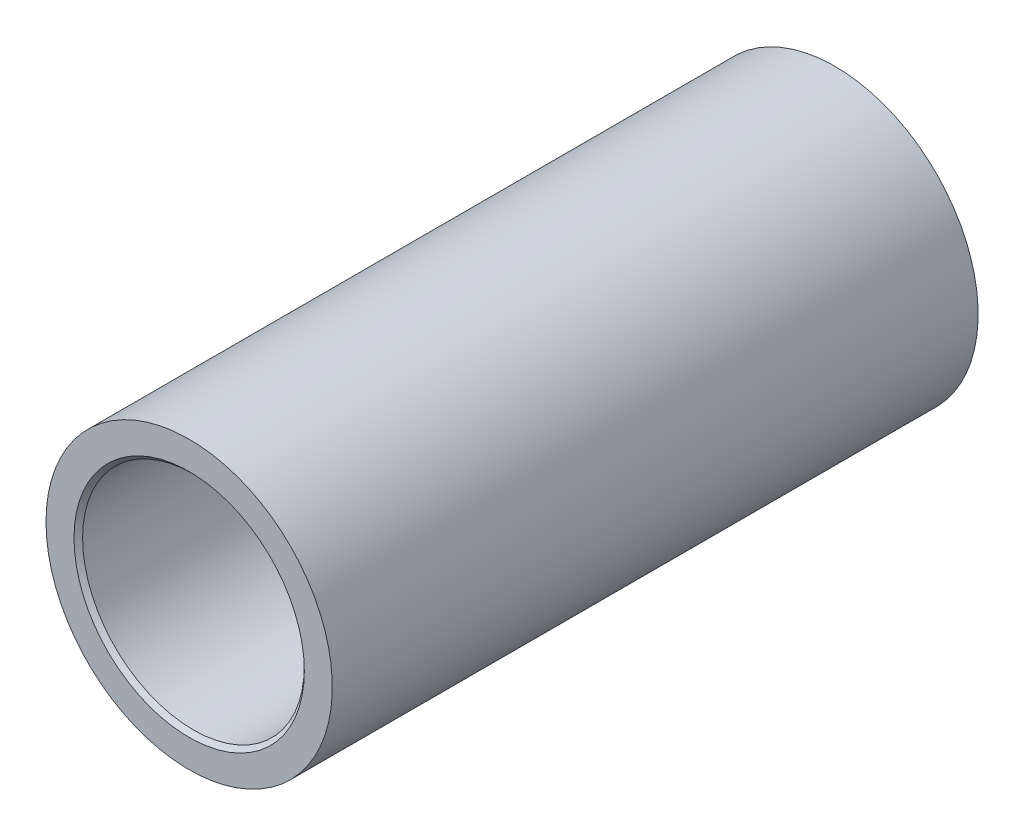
ISO-10303-21;
HEADER;
FILE_DESCRIPTION(('STEP AP214'),'2;1');
FILE_NAME('part.step','',(''),(''),'','','');
FILE_SCHEMA(('AUTOMOTIVE_DESIGN { 1 0 10303 214 1 1 1 1 }'));
ENDSEC;
DATA;
#1=APPLICATION_CONTEXT('core data for automotive mechanical design processes');
#2=APPLICATION_PROTOCOL_DEFINITION('international standard','automotive_design',2000,#1);
#3=PRODUCT_CONTEXT('',#1,'mechanical');
#4=PRODUCT('Part','Part','',(#3));
#5=PRODUCT_RELATED_PRODUCT_CATEGORY('part','',(#4));
#6=PRODUCT_DEFINITION_FORMATION('','',#4);
#7=PRODUCT_DEFINITION_CONTEXT('part definition',#1,'design');
#8=PRODUCT_DEFINITION('design','',#6,#7);
#9=PRODUCT_DEFINITION_SHAPE('','',#8);
#10=(LENGTH_UNIT() NAMED_UNIT(*) SI_UNIT(.MILLI.,.METRE.));
#11=(NAMED_UNIT(*) PLANE_ANGLE_UNIT() SI_UNIT($,.RADIAN.));
#12=(NAMED_UNIT(*) SI_UNIT($,.STERADIAN.) SOLID_ANGLE_UNIT());
#13=UNCERTAINTY_MEASURE_WITH_UNIT(LENGTH_MEASURE(1.E-05),#10,'distance_accuracy_value','');
#14=(GEOMETRIC_REPRESENTATION_CONTEXT(3) GLOBAL_UNCERTAINTY_ASSIGNED_CONTEXT((#13)) GLOBAL_UNIT_ASSIGNED_CONTEXT((#10,
#11,#12)) REPRESENTATION_CONTEXT('',''));
#15=CARTESIAN_POINT('',(0.,0.,0.));
#16=DIRECTION('',(0.,0.,1.));
#17=DIRECTION('',(1.,0.,0.));
#18=AXIS2_PLACEMENT_3D('',#15,#16,#17);
#19=CARTESIAN_POINT('',(0.,0.,38.1));
#20=DIRECTION('',(0.,0.,1.));
#21=DIRECTION('',(1.,0.,0.));
#22=AXIS2_PLACEMENT_3D('',#19,#20,#21);
#23=PLANE('',#22);
#24=CARTESIAN_POINT('',(0.,0.,38.1));
#25=DIRECTION('',(0.,0.,1.));
#26=DIRECTION('',(1.,0.,0.));
#27=AXIS2_PLACEMENT_3D('',#24,#25,#26);
#28=CIRCLE('',#27,6.79450000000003);
#29=CARTESIAN_POINT('',(6.79450000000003,0.,38.1));
#30=VERTEX_POINT('',#29);
#31=EDGE_CURVE('E10',#30,#30,#28,.F.);
#32=ORIENTED_EDGE('',*,*,#31,.T.);
#33=EDGE_LOOP('',(#32));
#34=FACE_BOUND('',#33,.T.);
#35=CARTESIAN_POINT('',(0.,0.,38.1));
#36=DIRECTION('',(0.,0.,1.));
#37=DIRECTION('',(1.,0.,0.));
#38=AXIS2_PLACEMENT_3D('',#35,#36,#37);
#39=CIRCLE('',#38,8.4455);
#40=CARTESIAN_POINT('',(-8.4455,0.,38.1));
#41=VERTEX_POINT('',#40);
#42=EDGE_CURVE('E56',#41,#41,#39,.T.);
#43=ORIENTED_EDGE('',*,*,#42,.T.);
#44=EDGE_LOOP('',(#43));
#45=FACE_BOUND('',#44,.T.);
#46=ADVANCED_FACE('F35',(#34,#45),#23,.T.);
#47=CARTESIAN_POINT('',(0.,0.,0.));
#48=DIRECTION('',(0.,0.,1.));
#49=DIRECTION('',(1.,0.,0.));
#50=AXIS2_PLACEMENT_3D('',#47,#48,#49);
#51=PLANE('',#50);
#52=CARTESIAN_POINT('',(0.,0.,0.));
#53=DIRECTION('',(0.,0.,1.));
#54=DIRECTION('',(1.,0.,0.));
#55=AXIS2_PLACEMENT_3D('',#52,#53,#54);
#56=CIRCLE('',#55,6.79449999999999);
#57=CARTESIAN_POINT('',(6.79449999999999,0.,0.));
#58=VERTEX_POINT('',#57);
#59=EDGE_CURVE('E51',#58,#58,#56,.T.);
#60=ORIENTED_EDGE('',*,*,#59,.T.);
#61=EDGE_LOOP('',(#60));
#62=FACE_BOUND('',#61,.T.);
#63=CARTESIAN_POINT('',(0.,0.,0.));
#64=DIRECTION('',(0.,0.,1.));
#65=DIRECTION('',(1.,0.,0.));
#66=AXIS2_PLACEMENT_3D('',#63,#64,#65);
#67=CIRCLE('',#66,8.4455);
#68=CARTESIAN_POINT('',(-8.4455,0.,0.));
#69=VERTEX_POINT('',#68);
#70=EDGE_CURVE('E57',#69,#69,#67,.T.);
#71=ORIENTED_EDGE('',*,*,#70,.F.);
#72=EDGE_LOOP('',(#71));
#73=FACE_BOUND('',#72,.T.);
#74=ADVANCED_FACE('F68',(#62,#73),#51,.F.);
#75=CARTESIAN_POINT('',(0.,0.,38.1));
#76=DIRECTION('',(0.,0.,-1.));
#77=DIRECTION('',(-1.,0.,0.));
#78=AXIS2_PLACEMENT_3D('',#75,#76,#77);
#79=CYLINDRICAL_SURFACE('',#78,8.4455);
#80=CARTESIAN_POINT('',(-8.4455,0.,38.1));
#81=CARTESIAN_POINT('',(-8.4455,0.,37.703125));
#82=CARTESIAN_POINT('',(-8.4455,0.,37.30625));
#83=CARTESIAN_POINT('',(-8.4455,0.,36.5125));
#84=CARTESIAN_POINT('',(-8.4455,0.,36.115625));
#85=CARTESIAN_POINT('',(-8.4455,0.,35.321875));
#86=CARTESIAN_POINT('',(-8.4455,0.,34.925));
#87=CARTESIAN_POINT('',(-8.4455,0.,34.13125));
#88=CARTESIAN_POINT('',(-8.4455,0.,33.734375));
#89=CARTESIAN_POINT('',(-8.4455,0.,32.940625));
#90=CARTESIAN_POINT('',(-8.4455,0.,32.54375));
#91=CARTESIAN_POINT('',(-8.4455,0.,31.75));
#92=CARTESIAN_POINT('',(-8.4455,0.,31.353125));
#93=CARTESIAN_POINT('',(-8.4455,0.,30.559375));
#94=CARTESIAN_POINT('',(-8.4455,0.,30.1625));
#95=CARTESIAN_POINT('',(-8.4455,0.,29.36875));
#96=CARTESIAN_POINT('',(-8.4455,0.,28.971875));
#97=CARTESIAN_POINT('',(-8.4455,0.,28.178125));
#98=CARTESIAN_POINT('',(-8.4455,0.,27.78125));
#99=CARTESIAN_POINT('',(-8.4455,0.,26.9875));
#100=CARTESIAN_POINT('',(-8.4455,0.,26.590625));
#101=CARTESIAN_POINT('',(-8.4455,0.,25.796875));
#102=CARTESIAN_POINT('',(-8.4455,0.,25.4));
#103=CARTESIAN_POINT('',(-8.4455,0.,24.60625));
#104=CARTESIAN_POINT('',(-8.4455,0.,24.209375));
#105=CARTESIAN_POINT('',(-8.4455,0.,23.415625));
#106=CARTESIAN_POINT('',(-8.4455,0.,23.01875));
#107=CARTESIAN_POINT('',(-8.4455,0.,22.225));
#108=CARTESIAN_POINT('',(-8.4455,0.,21.828125));
#109=CARTESIAN_POINT('',(-8.4455,0.,21.034375));
#110=CARTESIAN_POINT('',(-8.4455,0.,20.6375));
#111=CARTESIAN_POINT('',(-8.4455,0.,19.84375));
#112=CARTESIAN_POINT('',(-8.4455,0.,19.446875));
#113=CARTESIAN_POINT('',(-8.4455,0.,18.653125));
#114=CARTESIAN_POINT('',(-8.4455,0.,18.25625));
#115=CARTESIAN_POINT('',(-8.4455,0.,17.4625));
#116=CARTESIAN_POINT('',(-8.4455,0.,17.065625));
#117=CARTESIAN_POINT('',(-8.4455,0.,16.271875));
#118=CARTESIAN_POINT('',(-8.4455,0.,15.875));
#119=CARTESIAN_POINT('',(-8.4455,0.,15.08125));
#120=CARTESIAN_POINT('',(-8.4455,0.,14.684375));
#121=CARTESIAN_POINT('',(-8.4455,0.,13.890625));
#122=CARTESIAN_POINT('',(-8.4455,0.,13.49375));
#123=CARTESIAN_POINT('',(-8.4455,0.,12.7));
#124=CARTESIAN_POINT('',(-8.4455,0.,12.303125));
#125=CARTESIAN_POINT('',(-8.4455,0.,11.509375));
#126=CARTESIAN_POINT('',(-8.4455,0.,11.1125));
#127=CARTESIAN_POINT('',(-8.4455,0.,10.31875));
#128=CARTESIAN_POINT('',(-8.4455,0.,9.921875));
#129=CARTESIAN_POINT('',(-8.4455,0.,9.128125));
#130=CARTESIAN_POINT('',(-8.4455,0.,8.73125));
#131=CARTESIAN_POINT('',(-8.4455,0.,7.9375));
#132=CARTESIAN_POINT('',(-8.4455,0.,7.540625));
#133=CARTESIAN_POINT('',(-8.4455,0.,6.746875));
#134=CARTESIAN_POINT('',(-8.4455,0.,6.35));
#135=CARTESIAN_POINT('',(-8.4455,0.,5.55625));
#136=CARTESIAN_POINT('',(-8.4455,0.,5.159375));
#137=CARTESIAN_POINT('',(-8.4455,0.,4.365625));
#138=CARTESIAN_POINT('',(-8.4455,0.,3.96875));
#139=CARTESIAN_POINT('',(-8.4455,0.,3.175));
#140=CARTESIAN_POINT('',(-8.4455,0.,2.778125));
#141=CARTESIAN_POINT('',(-8.4455,0.,1.984375));
#142=CARTESIAN_POINT('',(-8.4455,0.,1.5875));
#143=CARTESIAN_POINT('',(-8.4455,0.,0.79375));
#144=CARTESIAN_POINT('',(-8.4455,0.,0.396875));
#145=CARTESIAN_POINT('',(-8.4455,0.,0.));
#146=B_SPLINE_CURVE_WITH_KNOTS('',3,(#80,#81,#82,#83,#84,#85,#86,#87,#88,#89,#90,#91,#92,#93,
#94,#95,#96,#97,#98,#99,#100,#101,#102,#103,#104,#105,#106,#107,#108,#109,#110,#111,#112,#113,
#114,#115,#116,#117,#118,#119,#120,#121,#122,#123,#124,#125,#126,#127,#128,#129,#130,#131,#132,
#133,#134,#135,#136,#137,#138,#139,#140,#141,#142,#143,#144,#145),.UNSPECIFIED.,.F.,.F.,(4,2,2,
2,2,2,2,2,2,2,2,2,2,2,2,2,2,2,2,2,2,2,2,2,2,2,2,2,2,2,2,2,4),(0.,1.19062499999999,
2.38124999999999,3.571875,4.7625,5.953125,7.14375,8.33437499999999,9.525,10.715625,11.90625,
13.096875,14.2875,15.478125,16.66875,17.859375,19.05,20.240625,21.43125,22.621875,23.8125,
25.003125,26.19375,27.384375,28.575,29.765625,30.95625,32.146875,33.3375,34.528125,35.71875,
36.909375,38.1),.UNSPECIFIED.);
#147=EDGE_CURVE('BSEAM64',#41,#69,#146,.T.);
#148=ORIENTED_EDGE('',*,*,#42,.F.);
#149=ORIENTED_EDGE('',*,*,#70,.T.);
#150=ORIENTED_EDGE('',*,*,#147,.T.);
#151=ORIENTED_EDGE('',*,*,#147,.F.);
#152=EDGE_LOOP('',(#148,#150,#149,#151));
#153=FACE_BOUND('',#152,.T.);
#154=ADVANCED_FACE('F64',(#153),#79,.T.);
#155=CARTESIAN_POINT('',(0.,0.,38.1));
#156=DIRECTION('',(0.,0.,-1.));
#157=DIRECTION('',(-1.,0.,0.));
#158=AXIS2_PLACEMENT_3D('',#155,#156,#157);
#159=CYLINDRICAL_SURFACE('',#158,6.5405);
#160=CARTESIAN_POINT('',(0.,0.,0.25399999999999));
#161=DIRECTION('',(0.,0.,1.));
#162=DIRECTION('',(1.,0.,0.));
#163=AXIS2_PLACEMENT_3D('',#160,#161,#162);
#164=CIRCLE('',#163,6.5405);
#165=CARTESIAN_POINT('',(-6.5405,0.,0.25399999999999));
#166=VERTEX_POINT('',#165);
#167=EDGE_CURVE('E43',#166,#166,#164,.F.);
#168=CARTESIAN_POINT('',(0.,0.,37.846));
#169=DIRECTION('',(0.,0.,1.));
#170=DIRECTION('',(1.,0.,0.));
#171=AXIS2_PLACEMENT_3D('',#168,#169,#170);
#172=CIRCLE('',#171,6.5405);
#173=CARTESIAN_POINT('',(-6.5405,0.,37.846));
#174=VERTEX_POINT('',#173);
#175=EDGE_CURVE('E47',#174,#174,#172,.T.);
#176=CARTESIAN_POINT('',(-6.5405,0.,0.25399999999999));
#177=CARTESIAN_POINT('',(-6.5405,0.,0.645583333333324));
#178=CARTESIAN_POINT('',(-6.5405,0.,1.03716666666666));
#179=CARTESIAN_POINT('',(-6.5405,0.,1.82033333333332));
#180=CARTESIAN_POINT('',(-6.5405,0.,2.21191666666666));
#181=CARTESIAN_POINT('',(-6.5405,0.,2.99508333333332));
#182=CARTESIAN_POINT('',(-6.5405,0.,3.38666666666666));
#183=CARTESIAN_POINT('',(-6.5405,0.,4.16983333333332));
#184=CARTESIAN_POINT('',(-6.5405,0.,4.56141666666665));
#185=CARTESIAN_POINT('',(-6.5405,0.,5.34458333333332));
#186=CARTESIAN_POINT('',(-6.5405,0.,5.73616666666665));
#187=CARTESIAN_POINT('',(-6.5405,0.,6.51933333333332));
#188=CARTESIAN_POINT('',(-6.5405,0.,6.91091666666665));
#189=CARTESIAN_POINT('',(-6.5405,0.,7.69408333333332));
#190=CARTESIAN_POINT('',(-6.5405,0.,8.08566666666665));
#191=CARTESIAN_POINT('',(-6.5405,0.,8.86883333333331));
#192=CARTESIAN_POINT('',(-6.5405,0.,9.26041666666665));
#193=CARTESIAN_POINT('',(-6.5405,0.,10.0435833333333));
#194=CARTESIAN_POINT('',(-6.5405,0.,10.4351666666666));
#195=CARTESIAN_POINT('',(-6.5405,0.,11.2183333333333));
#196=CARTESIAN_POINT('',(-6.5405,0.,11.6099166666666));
#197=CARTESIAN_POINT('',(-6.5405,0.,12.3930833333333));
#198=CARTESIAN_POINT('',(-6.5405,0.,12.7846666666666));
#199=CARTESIAN_POINT('',(-6.5405,0.,13.5678333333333));
#200=CARTESIAN_POINT('',(-6.5405,0.,13.9594166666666));
#201=CARTESIAN_POINT('',(-6.5405,0.,14.7425833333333));
#202=CARTESIAN_POINT('',(-6.5405,0.,15.1341666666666));
#203=CARTESIAN_POINT('',(-6.5405,0.,15.9173333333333));
#204=CARTESIAN_POINT('',(-6.5405,0.,16.3089166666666));
#205=CARTESIAN_POINT('',(-6.5405,0.,17.0920833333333));
#206=CARTESIAN_POINT('',(-6.5405,0.,17.4836666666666));
#207=CARTESIAN_POINT('',(-6.5405,0.,18.2668333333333));
#208=CARTESIAN_POINT('',(-6.5405,0.,18.6584166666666));
#209=CARTESIAN_POINT('',(-6.5405,0.,19.4415833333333));
#210=CARTESIAN_POINT('',(-6.5405,0.,19.8331666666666));
#211=CARTESIAN_POINT('',(-6.5405,0.,20.6163333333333));
#212=CARTESIAN_POINT('',(-6.5405,0.,21.0079166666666));
#213=CARTESIAN_POINT('',(-6.5405,0.,21.7910833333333));
#214=CARTESIAN_POINT('',(-6.5405,0.,22.1826666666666));
#215=CARTESIAN_POINT('',(-6.5405,0.,22.9658333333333));
#216=CARTESIAN_POINT('',(-6.5405,0.,23.3574166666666));
#217=CARTESIAN_POINT('',(-6.5405,0.,24.1405833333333));
#218=CARTESIAN_POINT('',(-6.5405,0.,24.5321666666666));
#219=CARTESIAN_POINT('',(-6.5405,0.,25.3153333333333));
#220=CARTESIAN_POINT('',(-6.5405,0.,25.7069166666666));
#221=CARTESIAN_POINT('',(-6.5405,0.,26.4900833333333));
#222=CARTESIAN_POINT('',(-6.5405,0.,26.8816666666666));
#223=CARTESIAN_POINT('',(-6.5405,0.,27.6648333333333));
#224=CARTESIAN_POINT('',(-6.5405,0.,28.0564166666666));
#225=CARTESIAN_POINT('',(-6.5405,0.,28.8395833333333));
#226=CARTESIAN_POINT('',(-6.5405,0.,29.2311666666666));
#227=CARTESIAN_POINT('',(-6.5405,0.,30.0143333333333));
#228=CARTESIAN_POINT('',(-6.5405,0.,30.4059166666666));
#229=CARTESIAN_POINT('',(-6.5405,0.,31.1890833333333));
#230=CARTESIAN_POINT('',(-6.5405,0.,31.5806666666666));
#231=CARTESIAN_POINT('',(-6.5405,0.,32.3638333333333));
#232=CARTESIAN_POINT('',(-6.5405,0.,32.7554166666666));
#233=CARTESIAN_POINT('',(-6.5405,0.,33.5385833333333));
#234=CARTESIAN_POINT('',(-6.5405,0.,33.9301666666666));
#235=CARTESIAN_POINT('',(-6.5405,0.,34.7133333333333));
#236=CARTESIAN_POINT('',(-6.5405,0.,35.1049166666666));
#237=CARTESIAN_POINT('',(-6.5405,0.,35.8880833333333));
#238=CARTESIAN_POINT('',(-6.5405,0.,36.2796666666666));
#239=CARTESIAN_POINT('',(-6.5405,0.,37.0628333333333));
#240=CARTESIAN_POINT('',(-6.5405,0.,37.4544166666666));
#241=CARTESIAN_POINT('',(-6.5405,0.,37.846));
#242=B_SPLINE_CURVE_WITH_KNOTS('',3,(#176,#177,#178,#179,#180,#181,#182,#183,#184,#185,#186,
#187,#188,#189,#190,#191,#192,#193,#194,#195,#196,#197,#198,#199,#200,#201,#202,#203,#204,#205,
#206,#207,#208,#209,#210,#211,#212,#213,#214,#215,#216,#217,#218,#219,#220,#221,#222,#223,#224,
#225,#226,#227,#228,#229,#230,#231,#232,#233,#234,#235,#236,#237,#238,#239,#240,#241),
.UNSPECIFIED.,.F.,.F.,(4,2,2,2,2,2,2,2,2,2,2,2,2,2,2,2,2,2,2,2,2,2,2,2,2,2,2,2,2,2,2,2,4),(0.,
1.17475,2.3495,3.52425,4.69899999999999,5.87375,7.04849999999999,8.22324999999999,
9.39799999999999,10.57275,11.7475,12.92225,14.097,15.27175,16.4465,17.62125,18.796,19.97075,
21.1455,22.32025,23.495,24.66975,25.8445,27.01925,28.194,29.36875,30.5435,31.71825,32.893,
34.06775,35.2425,36.41725,37.592),.UNSPECIFIED.);
#243=EDGE_CURVE('BSEAM67',#166,#174,#242,.T.);
#244=ORIENTED_EDGE('',*,*,#167,.T.);
#245=ORIENTED_EDGE('',*,*,#175,.T.);
#246=ORIENTED_EDGE('',*,*,#243,.T.);
#247=ORIENTED_EDGE('',*,*,#243,.F.);
#248=EDGE_LOOP('',(#244,#246,#245,#247));
#249=FACE_BOUND('',#248,.T.);
#250=ADVANCED_FACE('F67',(#249),#159,.F.);
#251=CARTESIAN_POINT('',(0.,0.,0.));
#252=DIRECTION('',(0.,0.,-1.));
#253=DIRECTION('',(-1.,0.,0.));
#254=AXIS2_PLACEMENT_3D('',#251,#252,#253);
#255=CONICAL_SURFACE('',#254,6.79449999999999,0.78539816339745);
#256=ORIENTED_EDGE('',*,*,#167,.F.);
#257=EDGE_LOOP('',(#256));
#258=FACE_BOUND('',#257,.T.);
#259=ORIENTED_EDGE('',*,*,#59,.F.);
#260=EDGE_LOOP('',(#259));
#261=FACE_BOUND('',#260,.T.);
#262=ADVANCED_FACE('F81',(#258,#261),#255,.F.);
#263=CARTESIAN_POINT('',(0.,0.,37.846));
#264=DIRECTION('',(0.,0.,1.));
#265=DIRECTION('',(1.,0.,0.));
#266=AXIS2_PLACEMENT_3D('',#263,#264,#265);
#267=CONICAL_SURFACE('',#266,6.5405,0.785398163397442);
#268=ORIENTED_EDGE('',*,*,#31,.F.);
#269=EDGE_LOOP('',(#268));
#270=FACE_BOUND('',#269,.T.);
#271=ORIENTED_EDGE('',*,*,#175,.F.);
#272=EDGE_LOOP('',(#271));
#273=FACE_BOUND('',#272,.T.);
#274=ADVANCED_FACE('F38',(#270,#273),#267,.F.);
#275=CLOSED_SHELL('',(#46,#74,#154,#250,#262,#274));
#276=MANIFOLD_SOLID_BREP('B2',#275);
#277=ADVANCED_BREP_SHAPE_REPRESENTATION('',(#18,#276),#14);
#278=SHAPE_DEFINITION_REPRESENTATION(#9,#277);
ENDSEC;
END-ISO-10303-21;
